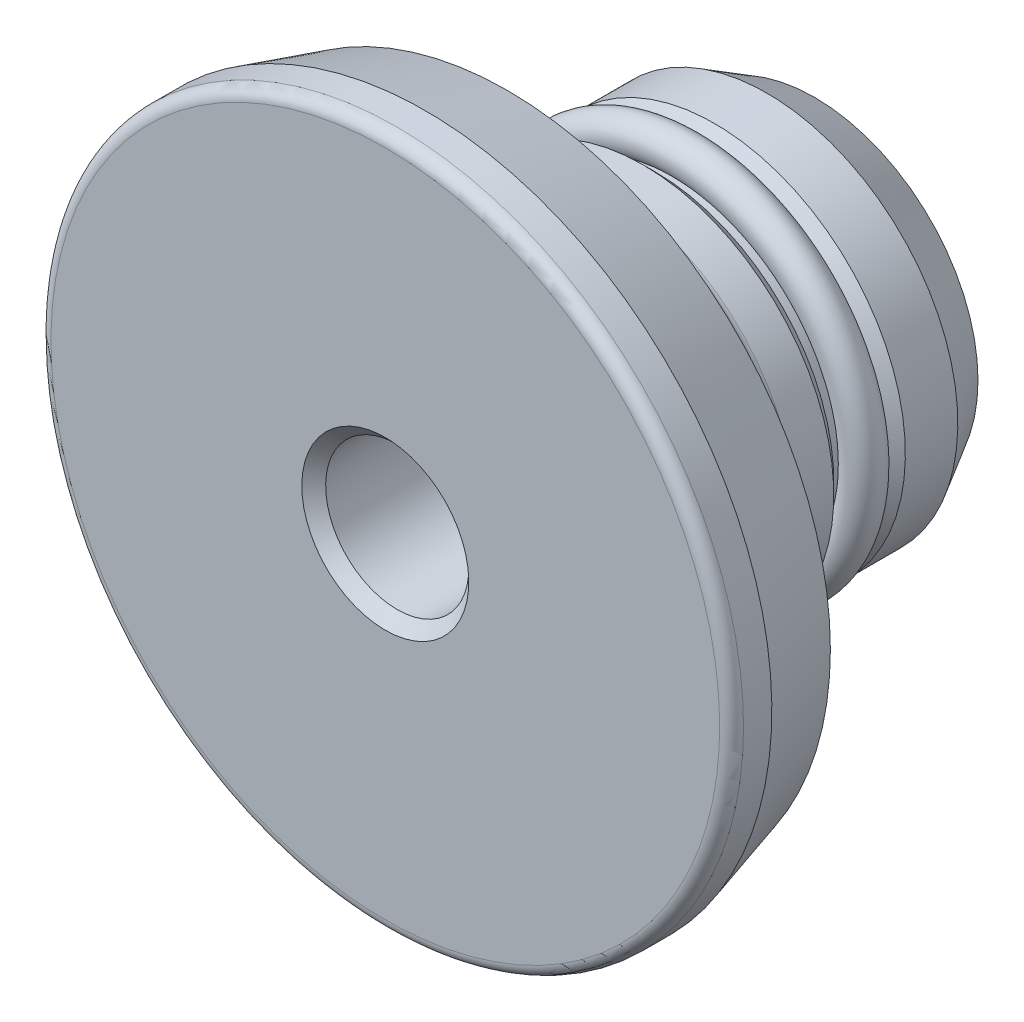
ISO-10303-21;
HEADER;
FILE_DESCRIPTION(('STEP AP214'),'2;1');
FILE_NAME('part.step','',(''),(''),'','','');
FILE_SCHEMA(('AUTOMOTIVE_DESIGN { 1 0 10303 214 1 1 1 1 }'));
ENDSEC;
DATA;
#1=APPLICATION_CONTEXT('core data for automotive mechanical design processes');
#2=APPLICATION_PROTOCOL_DEFINITION('international standard','automotive_design',2000,#1);
#3=PRODUCT_CONTEXT('',#1,'mechanical');
#4=PRODUCT('Part','Part','',(#3));
#5=PRODUCT_RELATED_PRODUCT_CATEGORY('part','',(#4));
#6=PRODUCT_DEFINITION_FORMATION('','',#4);
#7=PRODUCT_DEFINITION_CONTEXT('part definition',#1,'design');
#8=PRODUCT_DEFINITION('design','',#6,#7);
#9=PRODUCT_DEFINITION_SHAPE('','',#8);
#10=(LENGTH_UNIT() NAMED_UNIT(*) SI_UNIT(.MILLI.,.METRE.));
#11=(NAMED_UNIT(*) PLANE_ANGLE_UNIT() SI_UNIT($,.RADIAN.));
#12=(NAMED_UNIT(*) SI_UNIT($,.STERADIAN.) SOLID_ANGLE_UNIT());
#13=UNCERTAINTY_MEASURE_WITH_UNIT(LENGTH_MEASURE(1.E-05),#10,'distance_accuracy_value','');
#14=(GEOMETRIC_REPRESENTATION_CONTEXT(3) GLOBAL_UNCERTAINTY_ASSIGNED_CONTEXT((#13)) GLOBAL_UNIT_ASSIGNED_CONTEXT((#10,
#11,#12)) REPRESENTATION_CONTEXT('',''));
#15=CARTESIAN_POINT('',(0.,0.,0.));
#16=DIRECTION('',(0.,0.,1.));
#17=DIRECTION('',(1.,0.,0.));
#18=AXIS2_PLACEMENT_3D('',#15,#16,#17);
#19=CARTESIAN_POINT('',(0.,0.,0.));
#20=DIRECTION('',(0.,0.,1.));
#21=DIRECTION('',(0.,-1.,0.));
#22=AXIS2_PLACEMENT_3D('',#19,#20,#21);
#23=CYLINDRICAL_SURFACE('',#22,8.);
#24=CARTESIAN_POINT('',(0.,0.,-10.8));
#25=DIRECTION('',(0.,0.,-1.));
#26=DIRECTION('',(0.,1.,0.));
#27=AXIS2_PLACEMENT_3D('',#24,#25,#26);
#28=CIRCLE('',#27,8.);
#29=CARTESIAN_POINT('',(0.,8.,-10.8));
#30=VERTEX_POINT('',#29);
#31=EDGE_CURVE('E69',#30,#30,#28,.F.);
#32=ORIENTED_EDGE('',*,*,#31,.T.);
#33=EDGE_LOOP('',(#32));
#34=FACE_BOUND('',#33,.T.);
#35=CARTESIAN_POINT('',(0.,0.,-9.2082268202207));
#36=DIRECTION('',(0.,0.,1.));
#37=DIRECTION('',(0.,-1.,0.));
#38=AXIS2_PLACEMENT_3D('',#35,#36,#37);
#39=CIRCLE('',#38,8.);
#40=CARTESIAN_POINT('',(0.,-8.,-9.2082268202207));
#41=VERTEX_POINT('',#40);
#42=EDGE_CURVE('E54',#41,#41,#39,.F.);
#43=ORIENTED_EDGE('',*,*,#42,.T.);
#44=EDGE_LOOP('',(#43));
#45=FACE_BOUND('',#44,.T.);
#46=ADVANCED_FACE('F12',(#34,#45),#23,.T.);
#47=CARTESIAN_POINT('',(0.,0.,0.));
#48=DIRECTION('',(0.,0.,-1.));
#49=DIRECTION('',(0.,1.,0.));
#50=AXIS2_PLACEMENT_3D('',#47,#48,#49);
#51=PLANE('',#50);
#52=CARTESIAN_POINT('',(0.,0.,0.));
#53=DIRECTION('',(0.,0.,-1.));
#54=DIRECTION('',(0.,1.,0.));
#55=AXIS2_PLACEMENT_3D('',#52,#53,#54);
#56=CIRCLE('',#55,14.0159792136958);
#57=CARTESIAN_POINT('',(0.,14.0159792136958,0.));
#58=VERTEX_POINT('',#57);
#59=EDGE_CURVE('E57',#58,#58,#56,.F.);
#60=ORIENTED_EDGE('',*,*,#59,.T.);
#61=EDGE_LOOP('',(#60));
#62=FACE_BOUND('',#61,.T.);
#63=CARTESIAN_POINT('',(0.,0.,0.));
#64=DIRECTION('',(0.,0.,1.));
#65=DIRECTION('',(0.,-1.,0.));
#66=AXIS2_PLACEMENT_3D('',#63,#64,#65);
#67=CIRCLE('',#66,3.5);
#68=CARTESIAN_POINT('',(0.,-3.5,0.));
#69=VERTEX_POINT('',#68);
#70=EDGE_CURVE('E30',#69,#69,#67,.T.);
#71=ORIENTED_EDGE('',*,*,#70,.F.);
#72=EDGE_LOOP('',(#71));
#73=FACE_BOUND('',#72,.T.);
#74=ADVANCED_FACE('F99',(#62,#73),#51,.F.);
#75=CARTESIAN_POINT('',(0.,0.,0.));
#76=DIRECTION('',(0.,0.,1.));
#77=DIRECTION('',(0.,-1.,0.));
#78=AXIS2_PLACEMENT_3D('',#75,#76,#77);
#79=CYLINDRICAL_SURFACE('',#78,14.5159792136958);
#80=CARTESIAN_POINT('',(0.,0.,-0.5));
#81=DIRECTION('',(0.,0.,-1.));
#82=DIRECTION('',(0.,1.,0.));
#83=AXIS2_PLACEMENT_3D('',#80,#81,#82);
#84=CIRCLE('',#83,14.5159792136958);
#85=CARTESIAN_POINT('',(0.,14.5159792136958,-0.5));
#86=VERTEX_POINT('',#85);
#87=EDGE_CURVE('E60',#86,#86,#84,.T.);
#88=ORIENTED_EDGE('',*,*,#87,.T.);
#89=EDGE_LOOP('',(#88));
#90=FACE_BOUND('',#89,.T.);
#91=CARTESIAN_POINT('',(0.,0.,-1.6879810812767));
#92=DIRECTION('',(0.,0.,1.));
#93=DIRECTION('',(0.,-1.,0.));
#94=AXIS2_PLACEMENT_3D('',#91,#92,#93);
#95=CIRCLE('',#94,14.5159792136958);
#96=CARTESIAN_POINT('',(0.,-14.5159792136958,-1.6879810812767));
#97=VERTEX_POINT('',#96);
#98=EDGE_CURVE('E36',#97,#97,#95,.T.);
#99=ORIENTED_EDGE('',*,*,#98,.T.);
#100=EDGE_LOOP('',(#99));
#101=FACE_BOUND('',#100,.T.);
#102=ADVANCED_FACE('F107',(#90,#101),#79,.T.);
#103=CARTESIAN_POINT('',(0.,0.,-5.1281922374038));
#104=DIRECTION('',(0.,0.,1.));
#105=DIRECTION('',(0.,-1.,0.));
#106=AXIS2_PLACEMENT_3D('',#103,#104,#105);
#107=CONICAL_SURFACE('',#106,13.5295145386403,0.279252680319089);
#108=ORIENTED_EDGE('',*,*,#98,.F.);
#109=EDGE_LOOP('',(#108));
#110=FACE_BOUND('',#109,.T.);
#111=CARTESIAN_POINT('',(0.,0.,-5.1281922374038));
#112=DIRECTION('',(0.,0.,1.));
#113=DIRECTION('',(0.,-1.,0.));
#114=AXIS2_PLACEMENT_3D('',#111,#112,#113);
#115=CIRCLE('',#114,13.5295145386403);
#116=CARTESIAN_POINT('',(0.,-13.5295145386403,-5.1281922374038));
#117=VERTEX_POINT('',#116);
#118=EDGE_CURVE('E33',#117,#117,#115,.T.);
#119=ORIENTED_EDGE('',*,*,#118,.T.);
#120=EDGE_LOOP('',(#119));
#121=FACE_BOUND('',#120,.T.);
#122=ADVANCED_FACE('F176',(#110,#121),#107,.T.);
#123=CARTESIAN_POINT('',(0.,0.,-9.));
#124=DIRECTION('',(0.,0.,1.));
#125=DIRECTION('',(0.,-1.,0.));
#126=AXIS2_PLACEMENT_3D('',#123,#124,#125);
#127=CONICAL_SURFACE('',#126,8.,0.959931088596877);
#128=CARTESIAN_POINT('',(0.,0.,-8.8805660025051));
#129=DIRECTION('',(0.,0.,1.));
#130=DIRECTION('',(0.,-1.,0.));
#131=AXIS2_PLACEMENT_3D('',#128,#129,#130);
#132=CIRCLE('',#131,8.17056942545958);
#133=CARTESIAN_POINT('',(0.,-8.17056942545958,-8.8805660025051));
#134=VERTEX_POINT('',#133);
#135=EDGE_CURVE('E51',#134,#134,#132,.T.);
#136=ORIENTED_EDGE('',*,*,#135,.T.);
#137=EDGE_LOOP('',(#136));
#138=FACE_BOUND('',#137,.T.);
#139=ORIENTED_EDGE('',*,*,#118,.F.);
#140=EDGE_LOOP('',(#139));
#141=FACE_BOUND('',#140,.T.);
#142=ADVANCED_FACE('F148',(#138,#141),#127,.T.);
#143=CARTESIAN_POINT('',(6.75,0.,-11.3));
#144=DIRECTION('',(0.,0.,-1.));
#145=DIRECTION('',(0.,1.,0.));
#146=AXIS2_PLACEMENT_3D('',#143,#144,#145);
#147=PLANE('',#146);
#148=CARTESIAN_POINT('',(0.,0.,-11.3));
#149=DIRECTION('',(0.,0.,-1.));
#150=DIRECTION('',(0.,1.,0.));
#151=AXIS2_PLACEMENT_3D('',#148,#149,#150);
#152=CIRCLE('',#151,7.5);
#153=CARTESIAN_POINT('',(0.,7.5,-11.3));
#154=VERTEX_POINT('',#153);
#155=EDGE_CURVE('E24',#154,#154,#152,.T.);
#156=ORIENTED_EDGE('',*,*,#155,.T.);
#157=EDGE_LOOP('',(#156));
#158=FACE_BOUND('',#157,.T.);
#159=CARTESIAN_POINT('',(0.,0.,-11.3));
#160=DIRECTION('',(0.,0.,-1.));
#161=DIRECTION('',(0.,1.,0.));
#162=AXIS2_PLACEMENT_3D('',#159,#160,#161);
#163=CIRCLE('',#162,7.15);
#164=CARTESIAN_POINT('',(0.,7.15,-11.3));
#165=VERTEX_POINT('',#164);
#166=EDGE_CURVE('E48',#165,#165,#163,.F.);
#167=ORIENTED_EDGE('',*,*,#166,.T.);
#168=EDGE_LOOP('',(#167));
#169=FACE_BOUND('',#168,.T.);
#170=ADVANCED_FACE('F144',(#158,#169),#147,.T.);
#171=CARTESIAN_POINT('',(0.,0.,0.));
#172=DIRECTION('',(0.,0.,1.));
#173=DIRECTION('',(0.,-1.,0.));
#174=AXIS2_PLACEMENT_3D('',#171,#172,#173);
#175=CYLINDRICAL_SURFACE('',#174,6.75);
#176=CARTESIAN_POINT('',(0.,0.,-12.4739911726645));
#177=DIRECTION('',(0.,0.,1.));
#178=DIRECTION('',(0.,-1.,0.));
#179=AXIS2_PLACEMENT_3D('',#176,#177,#178);
#180=CIRCLE('',#179,6.75);
#181=CARTESIAN_POINT('',(0.,-6.75,-12.4739911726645));
#182=VERTEX_POINT('',#181);
#183=EDGE_CURVE('E16',#182,#182,#180,.F.);
#184=ORIENTED_EDGE('',*,*,#183,.F.);
#185=EDGE_LOOP('',(#184));
#186=FACE_BOUND('',#185,.T.);
#187=CARTESIAN_POINT('',(0.,0.,-11.7));
#188=DIRECTION('',(0.,0.,-1.));
#189=DIRECTION('',(0.,1.,0.));
#190=AXIS2_PLACEMENT_3D('',#187,#188,#189);
#191=CIRCLE('',#190,6.75);
#192=CARTESIAN_POINT('',(0.,6.75,-11.7));
#193=VERTEX_POINT('',#192);
#194=EDGE_CURVE('E45',#193,#193,#191,.T.);
#195=ORIENTED_EDGE('',*,*,#194,.T.);
#196=EDGE_LOOP('',(#195));
#197=FACE_BOUND('',#196,.T.);
#198=ADVANCED_FACE('F147',(#186,#197),#175,.T.);
#199=CARTESIAN_POINT('',(0.,0.,-11.7));
#200=DIRECTION('',(0.,0.,-1.));
#201=DIRECTION('',(0.,1.,0.));
#202=AXIS2_PLACEMENT_3D('',#199,#200,#201);
#203=TOROIDAL_SURFACE('',#202,7.15,0.4);
#204=ORIENTED_EDGE('',*,*,#194,.F.);
#205=EDGE_LOOP('',(#204));
#206=FACE_BOUND('',#205,.T.);
#207=ORIENTED_EDGE('',*,*,#166,.F.);
#208=EDGE_LOOP('',(#207));
#209=FACE_BOUND('',#208,.T.);
#210=ADVANCED_FACE('F151',(#206,#209),#203,.F.);
#211=CARTESIAN_POINT('',(0.,0.,-9.2082268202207));
#212=DIRECTION('',(0.,0.,1.));
#213=DIRECTION('',(0.,-1.,0.));
#214=AXIS2_PLACEMENT_3D('',#211,#212,#213);
#215=TOROIDAL_SURFACE('',#214,8.4,0.4);
#216=ORIENTED_EDGE('',*,*,#42,.F.);
#217=EDGE_LOOP('',(#216));
#218=FACE_BOUND('',#217,.T.);
#219=ORIENTED_EDGE('',*,*,#135,.F.);
#220=EDGE_LOOP('',(#219));
#221=FACE_BOUND('',#220,.T.);
#222=ADVANCED_FACE('F155',(#218,#221),#215,.F.);
#223=CARTESIAN_POINT('',(0.,0.,0.));
#224=DIRECTION('',(0.,0.,1.));
#225=DIRECTION('',(0.,-1.,0.));
#226=AXIS2_PLACEMENT_3D('',#223,#224,#225);
#227=CONICAL_SURFACE('',#226,3.5,0.785398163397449);
#228=CARTESIAN_POINT('',(0.,0.,-0.5));
#229=DIRECTION('',(0.,0.,1.));
#230=DIRECTION('',(0.,-1.,0.));
#231=AXIS2_PLACEMENT_3D('',#228,#229,#230);
#232=CIRCLE('',#231,3.);
#233=CARTESIAN_POINT('',(0.,-3.,-0.5));
#234=VERTEX_POINT('',#233);
#235=EDGE_CURVE('E29',#234,#234,#232,.F.);
#236=ORIENTED_EDGE('',*,*,#235,.T.);
#237=EDGE_LOOP('',(#236));
#238=FACE_BOUND('',#237,.T.);
#239=ORIENTED_EDGE('',*,*,#70,.T.);
#240=EDGE_LOOP('',(#239));
#241=FACE_BOUND('',#240,.T.);
#242=ADVANCED_FACE('F76',(#238,#241),#227,.F.);
#243=CARTESIAN_POINT('',(0.,0.,-0.5));
#244=DIRECTION('',(0.,0.,-1.));
#245=DIRECTION('',(0.,1.,0.));
#246=AXIS2_PLACEMENT_3D('',#243,#244,#245);
#247=TOROIDAL_SURFACE('',#246,14.0159792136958,0.5);
#248=ORIENTED_EDGE('',*,*,#87,.F.);
#249=EDGE_LOOP('',(#248));
#250=FACE_BOUND('',#249,.T.);
#251=ORIENTED_EDGE('',*,*,#59,.F.);
#252=EDGE_LOOP('',(#251));
#253=FACE_BOUND('',#252,.T.);
#254=ADVANCED_FACE('F154',(#250,#253),#247,.T.);
#255=CARTESIAN_POINT('',(0.,0.,-10.8));
#256=DIRECTION('',(0.,0.,1.));
#257=DIRECTION('',(0.,-1.,0.));
#258=AXIS2_PLACEMENT_3D('',#255,#256,#257);
#259=CONICAL_SURFACE('',#258,8.,0.78539816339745);
#260=ORIENTED_EDGE('',*,*,#155,.F.);
#261=EDGE_LOOP('',(#260));
#262=FACE_BOUND('',#261,.T.);
#263=ORIENTED_EDGE('',*,*,#31,.F.);
#264=EDGE_LOOP('',(#263));
#265=FACE_BOUND('',#264,.T.);
#266=ADVANCED_FACE('F14',(#262,#265),#259,.T.);
#267=CARTESIAN_POINT('',(0.,0.,-6.));
#268=DIRECTION('',(0.,0.,1.));
#269=DIRECTION('',(0.,-1.,0.));
#270=AXIS2_PLACEMENT_3D('',#267,#268,#269);
#271=PLANE('',#270);
#272=CARTESIAN_POINT('',(0.,0.,-6.));
#273=DIRECTION('',(0.,0.,1.));
#274=DIRECTION('',(0.,-1.,0.));
#275=AXIS2_PLACEMENT_3D('',#272,#273,#274);
#276=CIRCLE('',#275,3.);
#277=CARTESIAN_POINT('',(0.,-3.,-6.));
#278=VERTEX_POINT('',#277);
#279=EDGE_CURVE('E26',#278,#278,#276,.T.);
#280=ORIENTED_EDGE('',*,*,#279,.T.);
#281=EDGE_LOOP('',(#280));
#282=FACE_BOUND('',#281,.T.);
#283=ADVANCED_FACE('F82',(#282),#271,.T.);
#284=CARTESIAN_POINT('',(0.,0.,-6.));
#285=DIRECTION('',(0.,0.,1.));
#286=DIRECTION('',(0.,-1.,0.));
#287=AXIS2_PLACEMENT_3D('',#284,#285,#286);
#288=CYLINDRICAL_SURFACE('',#287,3.);
#289=ORIENTED_EDGE('',*,*,#279,.F.);
#290=EDGE_LOOP('',(#289));
#291=FACE_BOUND('',#290,.T.);
#292=ORIENTED_EDGE('',*,*,#235,.F.);
#293=EDGE_LOOP('',(#292));
#294=FACE_BOUND('',#293,.T.);
#295=ADVANCED_FACE('F79',(#291,#294),#288,.F.);
#296=CARTESIAN_POINT('',(0.,-7.5,-12.4739911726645));
#297=DIRECTION('',(0.,0.,1.));
#298=DIRECTION('',(0.,-1.,0.));
#299=AXIS2_PLACEMENT_3D('',#296,#297,#298);
#300=PLANE('',#299);
#301=CARTESIAN_POINT('',(0.,0.,-12.4739911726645));
#302=DIRECTION('',(0.,0.,-1.));
#303=DIRECTION('',(0.,1.,0.));
#304=AXIS2_PLACEMENT_3D('',#301,#302,#303);
#305=CIRCLE('',#304,6.75386150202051);
#306=CARTESIAN_POINT('',(0.,6.75386150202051,-12.4739911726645));
#307=VERTEX_POINT('',#306);
#308=EDGE_CURVE('E8',#307,#307,#305,.T.);
#309=ORIENTED_EDGE('',*,*,#308,.F.);
#310=EDGE_LOOP('',(#309));
#311=FACE_BOUND('',#310,.T.);
#312=ORIENTED_EDGE('',*,*,#183,.T.);
#313=EDGE_LOOP('',(#312));
#314=FACE_BOUND('',#313,.T.);
#315=ADVANCED_FACE('F81',(#311,#314),#300,.T.);
#316=CARTESIAN_POINT('',(0.,0.,-12.55));
#317=DIRECTION('',(0.,0.,-1.));
#318=DIRECTION('',(-1.,0.,0.));
#319=AXIS2_PLACEMENT_3D('',#316,#317,#318);
#320=TOROIDAL_SURFACE('',#319,7.5,0.75);
#321=ORIENTED_EDGE('',*,*,#308,.T.);
#322=EDGE_LOOP('',(#321));
#323=FACE_BOUND('',#322,.T.);
#324=CARTESIAN_POINT('',(0.,0.,-13.3));
#325=DIRECTION('',(0.,0.,1.));
#326=DIRECTION('',(0.,-1.,0.));
#327=AXIS2_PLACEMENT_3D('',#324,#325,#326);
#328=CIRCLE('',#327,7.5);
#329=CARTESIAN_POINT('',(0.,-7.5,-13.3));
#330=VERTEX_POINT('',#329);
#331=EDGE_CURVE('E63',#330,#330,#328,.T.);
#332=ORIENTED_EDGE('',*,*,#331,.T.);
#333=EDGE_LOOP('',(#332));
#334=FACE_BOUND('',#333,.T.);
#335=ADVANCED_FACE('F91',(#323,#334),#320,.T.);
#336=CARTESIAN_POINT('',(8.,0.,-18.));
#337=DIRECTION('',(0.,0.,1.));
#338=DIRECTION('',(0.,-1.,0.));
#339=AXIS2_PLACEMENT_3D('',#336,#337,#338);
#340=PLANE('',#339);
#341=CARTESIAN_POINT('',(0.,0.,-18.));
#342=DIRECTION('',(0.,0.,1.));
#343=DIRECTION('',(0.,-1.,0.));
#344=AXIS2_PLACEMENT_3D('',#341,#342,#343);
#345=CIRCLE('',#344,6.84529946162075);
#346=CARTESIAN_POINT('',(0.,-6.84529946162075,-18.));
#347=VERTEX_POINT('',#346);
#348=EDGE_CURVE('E42',#347,#347,#345,.F.);
#349=ORIENTED_EDGE('',*,*,#348,.T.);
#350=EDGE_LOOP('',(#349));
#351=FACE_BOUND('',#350,.T.);
#352=ADVANCED_FACE('F123',(#351),#340,.F.);
#353=CARTESIAN_POINT('',(0.,0.,-16.));
#354=DIRECTION('',(0.,0.,1.));
#355=DIRECTION('',(0.,-1.,0.));
#356=AXIS2_PLACEMENT_3D('',#353,#354,#355);
#357=CONICAL_SURFACE('',#356,8.,0.523598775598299);
#358=ORIENTED_EDGE('',*,*,#348,.F.);
#359=EDGE_LOOP('',(#358));
#360=FACE_BOUND('',#359,.T.);
#361=CARTESIAN_POINT('',(0.,0.,-16.));
#362=DIRECTION('',(0.,0.,1.));
#363=DIRECTION('',(0.,-1.,0.));
#364=AXIS2_PLACEMENT_3D('',#361,#362,#363);
#365=CIRCLE('',#364,8.);
#366=CARTESIAN_POINT('',(0.,-8.,-16.));
#367=VERTEX_POINT('',#366);
#368=EDGE_CURVE('E39',#367,#367,#365,.T.);
#369=ORIENTED_EDGE('',*,*,#368,.F.);
#370=EDGE_LOOP('',(#369));
#371=FACE_BOUND('',#370,.T.);
#372=ADVANCED_FACE('F115',(#360,#371),#357,.T.);
#373=CARTESIAN_POINT('',(0.,0.,-13.8));
#374=DIRECTION('',(0.,0.,1.));
#375=DIRECTION('',(0.,-1.,0.));
#376=AXIS2_PLACEMENT_3D('',#373,#374,#375);
#377=CIRCLE('',#376,8.);
#378=CARTESIAN_POINT('',(0.,-8.,-13.8));
#379=VERTEX_POINT('',#378);
#380=EDGE_CURVE('E66',#379,#379,#377,.F.);
#381=ORIENTED_EDGE('',*,*,#380,.T.);
#382=EDGE_LOOP('',(#381));
#383=FACE_BOUND('',#382,.T.);
#384=ORIENTED_EDGE('',*,*,#368,.T.);
#385=EDGE_LOOP('',(#384));
#386=FACE_BOUND('',#385,.T.);
#387=ADVANCED_FACE('F102',(#383,#386),#23,.T.);
#388=CARTESIAN_POINT('',(0.,0.,-13.3));
#389=DIRECTION('',(0.,0.,-1.));
#390=DIRECTION('',(0.,1.,0.));
#391=AXIS2_PLACEMENT_3D('',#388,#389,#390);
#392=CONICAL_SURFACE('',#391,7.5,0.785398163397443);
#393=ORIENTED_EDGE('',*,*,#380,.F.);
#394=EDGE_LOOP('',(#393));
#395=FACE_BOUND('',#394,.T.);
#396=ORIENTED_EDGE('',*,*,#331,.F.);
#397=EDGE_LOOP('',(#396));
#398=FACE_BOUND('',#397,.T.);
#399=ADVANCED_FACE('F114',(#395,#398),#392,.T.);
#400=CLOSED_SHELL('',(#46,#74,#102,#122,#142,#170,#198,#210,#222,#242,#254,#266,#283,#295,#315,
#335,#352,#372,#387,#399));
#401=MANIFOLD_SOLID_BREP('B1',#400);
#402=ADVANCED_BREP_SHAPE_REPRESENTATION('',(#18,#401),#14);
#403=SHAPE_DEFINITION_REPRESENTATION(#9,#402);
ENDSEC;
END-ISO-10303-21;
